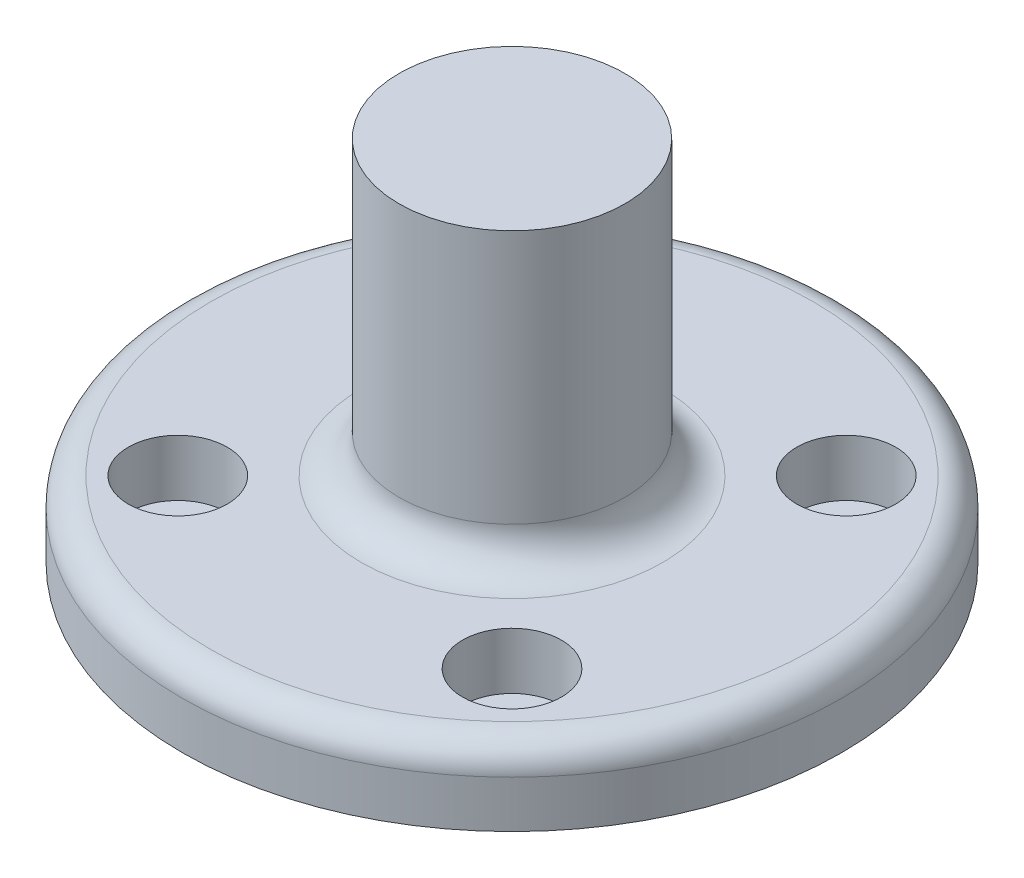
from build123d import *

# Parameters (mm, degrees)
SKETCH1_R           = 35
BOSS_EXTRUDE1_DEPTH = 8
SKETCH2_R           = 5.25
CUT_EXTRUDE1_DEPTH  = 6
SKETCH3_R           = 3.25
CUT_EXTRUDE2_DEPTH  = 2
SKETCH4_W           = 12
SKETCH4_H           = 31
FILLET1_R           = 3
FILLET2_R           = 4


with BuildPart() as part:
    # Sketch1 → Boss-Extrude1 (new body)
    with BuildSketch(Plane(origin=(0, 0, 0), x_dir=(1, 0, 0), z_dir=(0, 1, 0))):
        with Locations(Location((0, 0, 0), (0, 0, 270))):
            Circle(SKETCH1_R)
    extrude(amount=BOSS_EXTRUDE1_DEPTH)

    # Sketch2 → Cut-Extrude1 (cut)
    with BuildSketch(Plane(origin=(0, 8, 0), x_dir=(1, 0, 0), z_dir=(0, 1, 0))):
        with Locations(Location((-17.75, 17.75, 0), (0, 0, 270))):
            Circle(SKETCH2_R)
        with Locations(Location((17.75, 17.75, 0), (0, 0, 270))):
            Circle(SKETCH2_R)
        with Locations(Location((17.75, -17.75, 0), (0, 0, 270))):
            Circle(SKETCH2_R)
        with Locations(Location((-17.75, -17.75, 0), (0, 0, 270))):
            Circle(SKETCH2_R)
    extrude(amount=-CUT_EXTRUDE1_DEPTH, mode=Mode.SUBTRACT)

    # Sketch3 → Cut-Extrude2 (cut)
    with BuildSketch(Plane(origin=(0, 2, 0), x_dir=(1, 0, 0), z_dir=(0, 1, 0))):
        with Locations(Location((17.75, 17.75, 0), (0, 0, 270))):
            Circle(SKETCH3_R)
        with Locations(Location((-17.75, 17.75, 0), (0, 0, 270))):
            Circle(SKETCH3_R)
        with Locations(Location((-17.75, -17.75, 0), (0, 0, 270))):
            Circle(SKETCH3_R)
        with Locations(Location((17.75, -17.75, 0), (0, 0, 270))):
            Circle(SKETCH3_R)
    extrude(amount=-CUT_EXTRUDE2_DEPTH, mode=Mode.SUBTRACT)

    # Sketch4 → Revolve1 (revolve)
    with BuildSketch(Plane.XY, mode=Mode.PRIVATE) as revolve1_sk:
        with Locations((6, 23.5)):
            Rectangle(SKETCH4_W, SKETCH4_H)
    revolve(revolve1_sk.sketch.rotate(Axis((0, 39, 0), (0, -1, 0)), 90), axis=Axis((0, 39, 0), (0, -1, 0)))

    # Fillet1
    fillet1_edges = [part.edges().sort_by_distance(p)[0] for p in [
        (0, 8, -35),
    ]]
    fillet(fillet1_edges, radius=FILLET1_R)

    # Fillet2
    fillet2_edges = [part.edges().sort_by_distance(p)[0] for p in [
        (0, 8, -12),
    ]]
    fillet(fillet2_edges, radius=FILLET2_R)


solid = part.part
